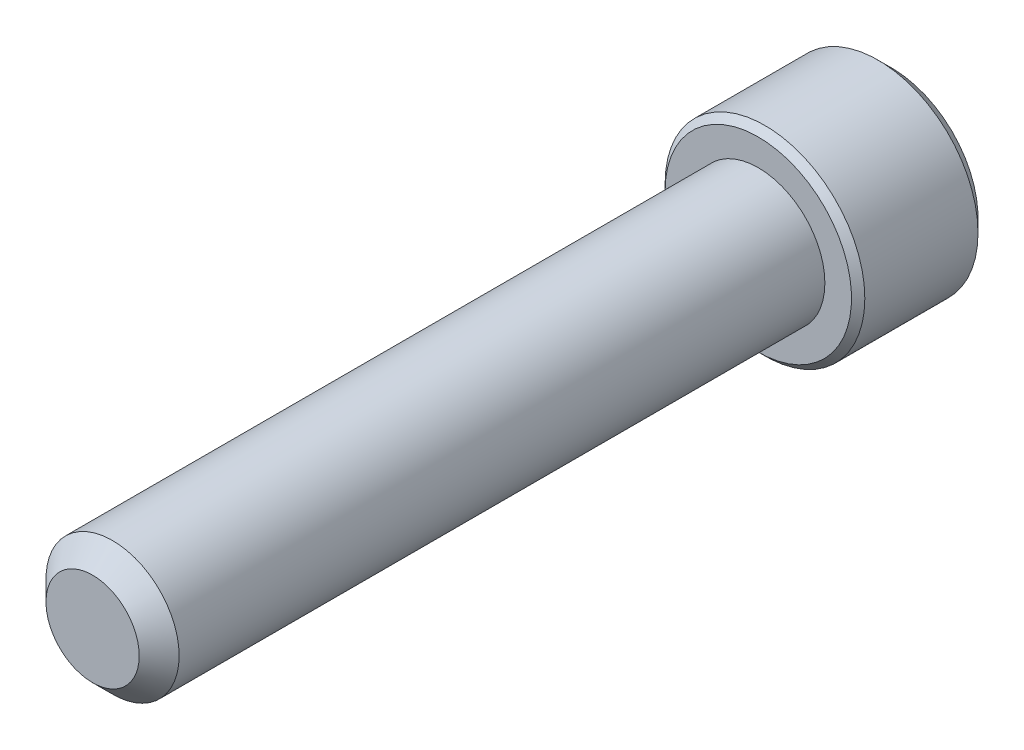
ISO-10303-21;
HEADER;
FILE_DESCRIPTION(('STEP AP214'),'2;1');
FILE_NAME('part.step','',(''),(''),'','','');
FILE_SCHEMA(('AUTOMOTIVE_DESIGN { 1 0 10303 214 1 1 1 1 }'));
ENDSEC;
DATA;
#1=APPLICATION_CONTEXT('core data for automotive mechanical design processes');
#2=APPLICATION_PROTOCOL_DEFINITION('international standard','automotive_design',2000,#1);
#3=PRODUCT_CONTEXT('',#1,'mechanical');
#4=PRODUCT('Part','Part','',(#3));
#5=PRODUCT_RELATED_PRODUCT_CATEGORY('part','',(#4));
#6=PRODUCT_DEFINITION_FORMATION('','',#4);
#7=PRODUCT_DEFINITION_CONTEXT('part definition',#1,'design');
#8=PRODUCT_DEFINITION('design','',#6,#7);
#9=PRODUCT_DEFINITION_SHAPE('','',#8);
#10=(LENGTH_UNIT() NAMED_UNIT(*) SI_UNIT(.MILLI.,.METRE.));
#11=(NAMED_UNIT(*) PLANE_ANGLE_UNIT() SI_UNIT($,.RADIAN.));
#12=(NAMED_UNIT(*) SI_UNIT($,.STERADIAN.) SOLID_ANGLE_UNIT());
#13=UNCERTAINTY_MEASURE_WITH_UNIT(LENGTH_MEASURE(1.E-05),#10,'distance_accuracy_value','');
#14=(GEOMETRIC_REPRESENTATION_CONTEXT(3) GLOBAL_UNCERTAINTY_ASSIGNED_CONTEXT((#13)) GLOBAL_UNIT_ASSIGNED_CONTEXT((#10,
#11,#12)) REPRESENTATION_CONTEXT('',''));
#15=CARTESIAN_POINT('',(0.,0.,0.));
#16=DIRECTION('',(0.,0.,1.));
#17=DIRECTION('',(1.,0.,0.));
#18=AXIS2_PLACEMENT_3D('',#15,#16,#17);
#19=CARTESIAN_POINT('',(0.,0.,-31.75));
#20=DIRECTION('',(0.,0.,1.));
#21=DIRECTION('',(1.,0.,0.));
#22=AXIS2_PLACEMENT_3D('',#19,#20,#21);
#23=CYLINDRICAL_SURFACE('',#22,3.175);
#24=CARTESIAN_POINT('',(0.,0.,-0.952499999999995));
#25=DIRECTION('',(0.,0.,1.));
#26=DIRECTION('',(1.,0.,0.));
#27=AXIS2_PLACEMENT_3D('',#24,#25,#26);
#28=CIRCLE('',#27,3.175);
#29=CARTESIAN_POINT('',(3.175,0.,-0.952499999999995));
#30=VERTEX_POINT('',#29);
#31=EDGE_CURVE('E109',#30,#30,#28,.F.);
#32=ORIENTED_EDGE('',*,*,#31,.T.);
#33=EDGE_LOOP('',(#32));
#34=FACE_BOUND('',#33,.T.);
#35=CARTESIAN_POINT('',(0.,0.,-31.75));
#36=DIRECTION('',(0.,0.,-1.));
#37=DIRECTION('',(-1.,0.,0.));
#38=AXIS2_PLACEMENT_3D('',#35,#36,#37);
#39=CIRCLE('',#38,3.175);
#40=CARTESIAN_POINT('',(-3.175,0.,-31.75));
#41=VERTEX_POINT('',#40);
#42=EDGE_CURVE('E209',#41,#41,#39,.F.);
#43=ORIENTED_EDGE('',*,*,#42,.T.);
#44=EDGE_LOOP('',(#43));
#45=FACE_BOUND('',#44,.T.);
#46=ADVANCED_FACE('F35',(#34,#45),#23,.T.);
#47=CARTESIAN_POINT('',(0.,0.,0.));
#48=DIRECTION('',(0.,0.,1.));
#49=DIRECTION('',(1.,0.,0.));
#50=AXIS2_PLACEMENT_3D('',#47,#48,#49);
#51=PLANE('',#50);
#52=CARTESIAN_POINT('',(0.,0.,0.));
#53=DIRECTION('',(0.,0.,1.));
#54=DIRECTION('',(1.,0.,0.));
#55=AXIS2_PLACEMENT_3D('',#52,#53,#54);
#56=CIRCLE('',#55,2.22250000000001);
#57=CARTESIAN_POINT('',(2.22250000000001,0.,0.));
#58=VERTEX_POINT('',#57);
#59=EDGE_CURVE('E208',#58,#58,#56,.T.);
#60=ORIENTED_EDGE('',*,*,#59,.T.);
#61=EDGE_LOOP('',(#60));
#62=FACE_BOUND('',#61,.T.);
#63=ADVANCED_FACE('F186',(#62),#51,.T.);
#64=CARTESIAN_POINT('',(0.,0.,0.));
#65=DIRECTION('',(0.,0.,-1.));
#66=DIRECTION('',(-1.,0.,0.));
#67=AXIS2_PLACEMENT_3D('',#64,#65,#66);
#68=CONICAL_SURFACE('',#67,2.22250000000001,0.785398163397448);
#69=ORIENTED_EDGE('',*,*,#31,.F.);
#70=EDGE_LOOP('',(#69));
#71=FACE_BOUND('',#70,.T.);
#72=ORIENTED_EDGE('',*,*,#59,.F.);
#73=EDGE_LOOP('',(#72));
#74=FACE_BOUND('',#73,.T.);
#75=ADVANCED_FACE('F192',(#71,#74),#68,.T.);
#76=CARTESIAN_POINT('',(0.,0.,-38.1));
#77=DIRECTION('',(0.,0.,1.));
#78=DIRECTION('',(1.,0.,0.));
#79=AXIS2_PLACEMENT_3D('',#76,#77,#78);
#80=CYLINDRICAL_SURFACE('',#79,4.7625);
#81=CARTESIAN_POINT('',(0.,0.,-32.0675));
#82=DIRECTION('',(0.,0.,-1.));
#83=DIRECTION('',(-1.,0.,0.));
#84=AXIS2_PLACEMENT_3D('',#81,#82,#83);
#85=CIRCLE('',#84,4.7625);
#86=CARTESIAN_POINT('',(-4.7625,0.,-32.0675));
#87=VERTEX_POINT('',#86);
#88=EDGE_CURVE('E43',#87,#87,#85,.T.);
#89=ORIENTED_EDGE('',*,*,#88,.T.);
#90=EDGE_LOOP('',(#89));
#91=FACE_BOUND('',#90,.T.);
#92=CARTESIAN_POINT('',(0.,0.,-37.465));
#93=DIRECTION('',(0.,0.,-1.));
#94=DIRECTION('',(-1.,0.,0.));
#95=AXIS2_PLACEMENT_3D('',#92,#93,#94);
#96=CIRCLE('',#95,4.7625);
#97=CARTESIAN_POINT('',(-4.7625,0.,-37.465));
#98=VERTEX_POINT('',#97);
#99=EDGE_CURVE('E169',#98,#98,#96,.F.);
#100=ORIENTED_EDGE('',*,*,#99,.T.);
#101=EDGE_LOOP('',(#100));
#102=FACE_BOUND('',#101,.T.);
#103=ADVANCED_FACE('F174',(#91,#102),#80,.T.);
#104=CARTESIAN_POINT('',(0.,0.,-38.1));
#105=DIRECTION('',(0.,0.,-1.));
#106=DIRECTION('',(-1.,0.,0.));
#107=AXIS2_PLACEMENT_3D('',#104,#105,#106);
#108=PLANE('',#107);
#109=CARTESIAN_POINT('',(0.,0.,-38.1));
#110=DIRECTION('',(0.,0.,-1.));
#111=DIRECTION('',(-1.,0.,0.));
#112=AXIS2_PLACEMENT_3D('',#109,#110,#111);
#113=CIRCLE('',#112,4.1275);
#114=CARTESIAN_POINT('',(-4.1275,0.,-38.1));
#115=VERTEX_POINT('',#114);
#116=EDGE_CURVE('E108',#115,#115,#113,.T.);
#117=ORIENTED_EDGE('',*,*,#116,.T.);
#118=EDGE_LOOP('',(#117));
#119=FACE_BOUND('',#118,.T.);
#120=CARTESIAN_POINT('',(0.,0.,-38.1));
#121=DIRECTION('',(0.,0.,-1.));
#122=DIRECTION('',(-1.,0.,0.));
#123=AXIS2_PLACEMENT_3D('',#120,#121,#122);
#124=CIRCLE('',#123,2.74963065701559);
#125=CARTESIAN_POINT('',(-2.38125,1.3748153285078,-38.1));
#126=VERTEX_POINT('',#125);
#127=CARTESIAN_POINT('',(0.,2.74963065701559,-38.1));
#128=VERTEX_POINT('',#127);
#129=EDGE_CURVE('E89',#126,#128,#124,.T.);
#130=ORIENTED_EDGE('',*,*,#129,.F.);
#131=CARTESIAN_POINT('',(-2.38125,-1.3748153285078,-38.1));
#132=VERTEX_POINT('',#131);
#133=EDGE_CURVE('E49',#132,#126,#124,.T.);
#134=ORIENTED_EDGE('',*,*,#133,.F.);
#135=CARTESIAN_POINT('',(0.,-2.74963065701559,-38.1));
#136=VERTEX_POINT('',#135);
#137=EDGE_CURVE('E265',#136,#132,#124,.T.);
#138=ORIENTED_EDGE('',*,*,#137,.F.);
#139=CARTESIAN_POINT('',(2.38125,-1.3748153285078,-38.1));
#140=VERTEX_POINT('',#139);
#141=EDGE_CURVE('E56',#140,#136,#124,.T.);
#142=ORIENTED_EDGE('',*,*,#141,.F.);
#143=CARTESIAN_POINT('',(2.38125,1.3748153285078,-38.1));
#144=VERTEX_POINT('',#143);
#145=EDGE_CURVE('E130',#144,#140,#124,.T.);
#146=ORIENTED_EDGE('',*,*,#145,.F.);
#147=EDGE_CURVE('E98',#128,#144,#124,.T.);
#148=ORIENTED_EDGE('',*,*,#147,.F.);
#149=EDGE_LOOP('',(#130,#134,#138,#142,#146,#148));
#150=FACE_BOUND('',#149,.T.);
#151=ADVANCED_FACE('F129',(#119,#150),#108,.T.);
#152=CARTESIAN_POINT('',(0.,0.,-31.75));
#153=DIRECTION('',(0.,0.,-1.));
#154=DIRECTION('',(-1.,0.,0.));
#155=AXIS2_PLACEMENT_3D('',#152,#153,#154);
#156=PLANE('',#155);
#157=CARTESIAN_POINT('',(0.,0.,-31.75));
#158=DIRECTION('',(0.,0.,-1.));
#159=DIRECTION('',(-1.,0.,0.));
#160=AXIS2_PLACEMENT_3D('',#157,#158,#159);
#161=CIRCLE('',#160,4.44500000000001);
#162=CARTESIAN_POINT('',(-4.445,0.,-31.75));
#163=VERTEX_POINT('',#162);
#164=EDGE_CURVE('E11',#163,#163,#161,.F.);
#165=ORIENTED_EDGE('',*,*,#164,.T.);
#166=EDGE_LOOP('',(#165));
#167=FACE_BOUND('',#166,.T.);
#168=ORIENTED_EDGE('',*,*,#42,.F.);
#169=EDGE_LOOP('',(#168));
#170=FACE_BOUND('',#169,.T.);
#171=ADVANCED_FACE('F277',(#167,#170),#156,.F.);
#172=CARTESIAN_POINT('',(0.,0.,-38.1));
#173=DIRECTION('',(0.,0.,-1.));
#174=DIRECTION('',(-1.,0.,0.));
#175=AXIS2_PLACEMENT_3D('',#172,#173,#174);
#176=CONICAL_SURFACE('',#175,2.74963065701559,0.78539816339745);
#177=ORIENTED_EDGE('',*,*,#147,.T.);
#178=CARTESIAN_POINT('',(-0.000199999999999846,2.74974612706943,-38.1001154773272));
#179=CARTESIAN_POINT('',(0.0816567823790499,2.70248609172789,-38.0528948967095));
#180=CARTESIAN_POINT('',(0.16488233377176,2.65443579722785,-38.0084475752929));
#181=CARTESIAN_POINT('',(0.33458848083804,2.556455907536,-37.9270654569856));
#182=CARTESIAN_POINT('',(0.421085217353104,2.50651699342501,-37.8901759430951));
#183=CARTESIAN_POINT('',(0.595501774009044,2.40581754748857,-37.8269834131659));
#184=CARTESIAN_POINT('',(0.683377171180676,2.35508266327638,-37.8005215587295));
#185=CARTESIAN_POINT('',(0.861062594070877,2.25249593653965,-37.7597515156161));
#186=CARTESIAN_POINT('',(0.950867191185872,2.20064722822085,-37.7454128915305));
#187=CARTESIAN_POINT('',(1.10563960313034,2.11128933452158,-37.7324757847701));
#188=CARTESIAN_POINT('',(1.17040744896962,2.07389560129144,-37.7305606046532));
#189=CARTESIAN_POINT('',(1.29983727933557,1.99916925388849,-37.7337866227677));
#190=CARTESIAN_POINT('',(1.36449921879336,1.96183666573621,-37.7389302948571));
#191=CARTESIAN_POINT('',(1.4932125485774,1.88752399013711,-37.7559813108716));
#192=CARTESIAN_POINT('',(1.55726317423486,1.85054434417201,-37.7678962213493));
#193=CARTESIAN_POINT('',(1.68425683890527,1.77722451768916,-37.797835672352));
#194=CARTESIAN_POINT('',(1.74719996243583,1.74088428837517,-37.8158597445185));
#195=CARTESIAN_POINT('',(1.90842615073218,1.64780030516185,-37.8693688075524));
#196=CARTESIAN_POINT('',(2.00570949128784,1.59163374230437,-37.9088874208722));
#197=CARTESIAN_POINT('',(2.14875606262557,1.50904576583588,-37.9756003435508));
#198=CARTESIAN_POINT('',(2.19589628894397,1.48182934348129,-37.9990402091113));
#199=CARTESIAN_POINT('',(2.28930352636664,1.42790064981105,-38.0480566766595));
#200=CARTESIAN_POINT('',(2.33557105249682,1.40118808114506,-38.0736319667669));
#201=CARTESIAN_POINT('',(2.38145,1.37469985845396,-38.1001154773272));
#202=B_SPLINE_CURVE_WITH_KNOTS('',3,(#178,#179,#180,#181,#182,#183,#184,#185,#186,#187,#188,
#189,#190,#191,#192,#193,#194,#195,#196,#197,#198,#199,#200,#201),.UNSPECIFIED.,.F.,.F.,(4,2,2,
2,2,2,2,2,2,2,2,4),(0.,0.317196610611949,0.636241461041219,0.950218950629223,1.26340583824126,
1.48752413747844,1.71172100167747,1.93616888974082,2.16059957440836,2.51709639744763,
2.69486147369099,2.87251813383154),.UNSPECIFIED.);
#203=EDGE_CURVE('E103',#128,#144,#202,.T.);
#204=ORIENTED_EDGE('',*,*,#203,.F.);
#205=EDGE_LOOP('',(#177,#204));
#206=FACE_BOUND('',#205,.T.);
#207=ADVANCED_FACE('F104',(#206),#176,.F.);
#208=ORIENTED_EDGE('',*,*,#145,.T.);
#209=CARTESIAN_POINT('',(2.38125,-2.76261914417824,-38.9976170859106));
#210=CARTESIAN_POINT('',(2.38125,-2.69544479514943,-38.9467472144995));
#211=CARTESIAN_POINT('',(2.38125,-2.62789666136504,-38.896362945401));
#212=CARTESIAN_POINT('',(2.38125,-2.49190448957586,-38.7967837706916));
#213=CARTESIAN_POINT('',(2.38125,-2.42346023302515,-38.7475891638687));
#214=CARTESIAN_POINT('',(2.38125,-2.28502676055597,-38.6502575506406));
#215=CARTESIAN_POINT('',(2.38125,-2.21502968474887,-38.6021316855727));
#216=CARTESIAN_POINT('',(2.38125,-2.07385103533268,-38.5076556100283));
#217=CARTESIAN_POINT('',(2.38125,-2.00266954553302,-38.461305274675));
#218=CARTESIAN_POINT('',(2.38125,-1.85474026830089,-38.3681368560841));
#219=CARTESIAN_POINT('',(2.38125,-1.7779099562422,-38.3214491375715));
#220=CARTESIAN_POINT('',(2.38125,-1.62247617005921,-38.2311296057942));
#221=CARTESIAN_POINT('',(2.38125,-1.5438729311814,-38.1874973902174));
#222=CARTESIAN_POINT('',(2.38125,-1.38486272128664,-38.1042071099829));
#223=CARTESIAN_POINT('',(2.38125,-1.30446163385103,-38.0645379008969));
#224=CARTESIAN_POINT('',(2.38125,-1.14145314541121,-37.9900690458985));
#225=CARTESIAN_POINT('',(2.38125,-1.05884677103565,-37.9552671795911));
#226=CARTESIAN_POINT('',(2.38125,-0.898296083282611,-37.8944298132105));
#227=CARTESIAN_POINT('',(2.38125,-0.820539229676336,-37.8679047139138));
#228=CARTESIAN_POINT('',(2.38125,-0.663135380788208,-37.82108983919));
#229=CARTESIAN_POINT('',(2.38125,-0.583488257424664,-37.8008004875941));
#230=CARTESIAN_POINT('',(2.38125,-0.424114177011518,-37.7678604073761));
#231=CARTESIAN_POINT('',(2.38125,-0.344414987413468,-37.7550775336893));
#232=CARTESIAN_POINT('',(2.38125,-0.184141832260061,-37.7374018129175));
#233=CARTESIAN_POINT('',(2.38125,-0.103568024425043,-37.7325075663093));
#234=CARTESIAN_POINT('',(2.38125,0.0546452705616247,-37.7309814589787));
#235=CARTESIAN_POINT('',(2.38125,0.132281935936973,-37.7340477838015));
#236=CARTESIAN_POINT('',(2.38125,0.28689976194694,-37.7476029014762));
#237=CARTESIAN_POINT('',(2.38125,0.363880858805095,-37.7580924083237));
#238=CARTESIAN_POINT('',(2.38125,0.517934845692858,-37.7860957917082));
#239=CARTESIAN_POINT('',(2.38125,0.594985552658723,-37.8037299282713));
#240=CARTESIAN_POINT('',(2.38125,0.747397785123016,-37.8450790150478));
#241=CARTESIAN_POINT('',(2.38125,0.822759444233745,-37.8687934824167));
#242=CARTESIAN_POINT('',(2.38125,1.05910849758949,-37.9521079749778));
#243=CARTESIAN_POINT('',(2.38125,1.21677702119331,-38.0211581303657));
#244=CARTESIAN_POINT('',(2.38125,1.44750538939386,-38.1362600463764));
#245=CARTESIAN_POINT('',(2.38125,1.52359597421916,-38.1766390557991));
#246=CARTESIAN_POINT('',(2.38125,1.67404919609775,-38.2605045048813));
#247=CARTESIAN_POINT('',(2.38125,1.74841214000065,-38.3039903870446));
#248=CARTESIAN_POINT('',(2.38125,1.89195740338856,-38.3912197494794));
#249=CARTESIAN_POINT('',(2.38125,1.96121356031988,-38.4348431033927));
#250=CARTESIAN_POINT('',(2.38125,2.09853826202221,-38.5239297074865));
#251=CARTESIAN_POINT('',(2.38125,2.16660671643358,-38.5693930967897));
#252=CARTESIAN_POINT('',(2.38125,2.30115854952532,-38.6614552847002));
#253=CARTESIAN_POINT('',(2.38125,2.36765030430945,-38.7080418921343));
#254=CARTESIAN_POINT('',(2.38125,2.49972444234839,-38.8024503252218));
#255=CARTESIAN_POINT('',(2.38125,2.56530707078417,-38.8502718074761));
#256=CARTESIAN_POINT('',(2.38125,2.63050907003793,-38.8985984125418));
#257=B_SPLINE_CURVE_WITH_KNOTS('',3,(#209,#210,#211,#212,#213,#214,#215,#216,#217,#218,#219,
#220,#221,#222,#223,#224,#225,#226,#227,#228,#229,#230,#231,#232,#233,#234,#235,#236,#237,#238,
#239,#240,#241,#242,#243,#244,#245,#246,#247,#248,#249,#250,#251,#252,#253,#254,#255,#256),
.UNSPECIFIED.,.F.,.F.,(4,2,2,2,2,2,2,2,2,2,2,2,2,2,2,2,2,2,2,2,2,2,2,4),(0.,0.25279187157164,
0.50564658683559,0.760459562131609,1.01525458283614,1.28490904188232,1.55452792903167,
1.82336591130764,2.09208085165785,2.33833488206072,2.58460564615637,2.82639989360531,
3.06815123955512,3.30087188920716,3.53361492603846,3.77045005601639,4.00726638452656,
4.52203846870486,4.78044014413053,5.03879556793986,5.28431582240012,5.52985467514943,
5.77340315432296,6.0168846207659),.UNSPECIFIED.);
#258=EDGE_CURVE('E97',#144,#140,#257,.F.);
#259=ORIENTED_EDGE('',*,*,#258,.F.);
#260=EDGE_LOOP('',(#208,#259));
#261=FACE_BOUND('',#260,.T.);
#262=ADVANCED_FACE('F271',(#261),#176,.F.);
#263=ORIENTED_EDGE('',*,*,#141,.T.);
#264=CARTESIAN_POINT('',(2.38145,-1.37469985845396,-38.1001154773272));
#265=CARTESIAN_POINT('',(2.29959321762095,-1.4219598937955,-38.0528948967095));
#266=CARTESIAN_POINT('',(2.21636766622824,-1.47001018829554,-38.0084475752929));
#267=CARTESIAN_POINT('',(2.04666151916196,-1.56799007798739,-37.9270654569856));
#268=CARTESIAN_POINT('',(1.9601647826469,-1.61792899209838,-37.8901759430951));
#269=CARTESIAN_POINT('',(1.78574822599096,-1.71862843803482,-37.8269834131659));
#270=CARTESIAN_POINT('',(1.69787282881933,-1.769363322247,-37.8005215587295));
#271=CARTESIAN_POINT('',(1.52018740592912,-1.87195004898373,-37.7597515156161));
#272=CARTESIAN_POINT('',(1.43038280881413,-1.92379875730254,-37.7454128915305));
#273=CARTESIAN_POINT('',(1.27561039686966,-2.01315665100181,-37.7324757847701));
#274=CARTESIAN_POINT('',(1.21084255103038,-2.05055038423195,-37.7305606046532));
#275=CARTESIAN_POINT('',(1.08141272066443,-2.1252767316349,-37.7337866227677));
#276=CARTESIAN_POINT('',(1.01675078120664,-2.16260931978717,-37.7389302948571));
#277=CARTESIAN_POINT('',(0.888037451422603,-2.23692199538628,-37.7559813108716));
#278=CARTESIAN_POINT('',(0.823986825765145,-2.27390164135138,-37.7678962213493));
#279=CARTESIAN_POINT('',(0.696993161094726,-2.34722146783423,-37.797835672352));
#280=CARTESIAN_POINT('',(0.634050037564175,-2.38356169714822,-37.8158597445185));
#281=CARTESIAN_POINT('',(0.472823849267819,-2.47664568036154,-37.8693688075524));
#282=CARTESIAN_POINT('',(0.37554050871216,-2.53281224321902,-37.9088874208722));
#283=CARTESIAN_POINT('',(0.232493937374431,-2.61540021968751,-37.9756003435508));
#284=CARTESIAN_POINT('',(0.185353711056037,-2.64261664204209,-37.9990402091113));
#285=CARTESIAN_POINT('',(0.0919464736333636,-2.69654533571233,-38.0480566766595));
#286=CARTESIAN_POINT('',(0.0456789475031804,-2.72325790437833,-38.0736319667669));
#287=CARTESIAN_POINT('',(-0.000199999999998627,-2.74974612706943,-38.1001154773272));
#288=B_SPLINE_CURVE_WITH_KNOTS('',3,(#264,#265,#266,#267,#268,#269,#270,#271,#272,#273,#274,
#275,#276,#277,#278,#279,#280,#281,#282,#283,#284,#285,#286,#287),.UNSPECIFIED.,.F.,.F.,(4,2,2,
2,2,2,2,2,2,2,2,4),(0.,0.317196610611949,0.636241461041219,0.950218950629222,1.26340583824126,
1.48752413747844,1.71172100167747,1.93616888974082,2.16059957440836,2.51709639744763,
2.69486147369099,2.87251813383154),.UNSPECIFIED.);
#289=EDGE_CURVE('E139',#140,#136,#288,.T.);
#290=ORIENTED_EDGE('',*,*,#289,.F.);
#291=EDGE_LOOP('',(#263,#290));
#292=FACE_BOUND('',#291,.T.);
#293=ADVANCED_FACE('F268',(#292),#176,.F.);
#294=ORIENTED_EDGE('',*,*,#137,.T.);
#295=CARTESIAN_POINT('',(0.000199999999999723,-2.74974612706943,-38.1001154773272));
#296=CARTESIAN_POINT('',(-0.0816567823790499,-2.70248609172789,-38.0528948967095));
#297=CARTESIAN_POINT('',(-0.16488233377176,-2.65443579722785,-38.0084475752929));
#298=CARTESIAN_POINT('',(-0.33458848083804,-2.556455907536,-37.9270654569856));
#299=CARTESIAN_POINT('',(-0.421085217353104,-2.50651699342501,-37.8901759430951));
#300=CARTESIAN_POINT('',(-0.595501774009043,-2.40581754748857,-37.8269834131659));
#301=CARTESIAN_POINT('',(-0.683377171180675,-2.35508266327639,-37.8005215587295));
#302=CARTESIAN_POINT('',(-0.861062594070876,-2.25249593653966,-37.7597515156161));
#303=CARTESIAN_POINT('',(-0.950867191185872,-2.20064722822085,-37.7454128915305));
#304=CARTESIAN_POINT('',(-1.10563960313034,-2.11128933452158,-37.7324757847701));
#305=CARTESIAN_POINT('',(-1.17040744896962,-2.07389560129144,-37.7305606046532));
#306=CARTESIAN_POINT('',(-1.29983727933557,-1.99916925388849,-37.7337866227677));
#307=CARTESIAN_POINT('',(-1.36449921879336,-1.96183666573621,-37.7389302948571));
#308=CARTESIAN_POINT('',(-1.4932125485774,-1.88752399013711,-37.7559813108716));
#309=CARTESIAN_POINT('',(-1.55726317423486,-1.85054434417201,-37.7678962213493));
#310=CARTESIAN_POINT('',(-1.68425683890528,-1.77722451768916,-37.797835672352));
#311=CARTESIAN_POINT('',(-1.74719996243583,-1.74088428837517,-37.8158597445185));
#312=CARTESIAN_POINT('',(-1.90842615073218,-1.64780030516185,-37.8693688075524));
#313=CARTESIAN_POINT('',(-2.00570949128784,-1.59163374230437,-37.9088874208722));
#314=CARTESIAN_POINT('',(-2.14875606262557,-1.50904576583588,-37.9756003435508));
#315=CARTESIAN_POINT('',(-2.19589628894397,-1.48182934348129,-37.9990402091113));
#316=CARTESIAN_POINT('',(-2.28930352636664,-1.42790064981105,-38.0480566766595));
#317=CARTESIAN_POINT('',(-2.33557105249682,-1.40118808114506,-38.0736319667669));
#318=CARTESIAN_POINT('',(-2.38145,-1.37469985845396,-38.1001154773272));
#319=B_SPLINE_CURVE_WITH_KNOTS('',3,(#295,#296,#297,#298,#299,#300,#301,#302,#303,#304,#305,
#306,#307,#308,#309,#310,#311,#312,#313,#314,#315,#316,#317,#318),.UNSPECIFIED.,.F.,.F.,(4,2,2,
2,2,2,2,2,2,2,2,4),(0.,0.317196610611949,0.636241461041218,0.950218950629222,1.26340583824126,
1.48752413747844,1.71172100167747,1.93616888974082,2.16059957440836,2.51709639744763,
2.69486147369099,2.87251813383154),.UNSPECIFIED.);
#320=EDGE_CURVE('E243',#136,#132,#319,.T.);
#321=ORIENTED_EDGE('',*,*,#320,.F.);
#322=EDGE_LOOP('',(#294,#321));
#323=FACE_BOUND('',#322,.T.);
#324=ADVANCED_FACE('F267',(#323),#176,.F.);
#325=ORIENTED_EDGE('',*,*,#133,.T.);
#326=CARTESIAN_POINT('',(-2.38125,-2.76261914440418,-38.9976170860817));
#327=CARTESIAN_POINT('',(-2.38125,-2.69544479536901,-38.9467472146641));
#328=CARTESIAN_POINT('',(-2.38125,-2.62789666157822,-38.8963629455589));
#329=CARTESIAN_POINT('',(-2.38125,-2.4919044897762,-38.7967837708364));
#330=CARTESIAN_POINT('',(-2.38125,-2.42346023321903,-38.7475891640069));
#331=CARTESIAN_POINT('',(-2.38125,-2.28502676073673,-38.6502575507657));
#332=CARTESIAN_POINT('',(-2.38125,-2.21502968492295,-38.6021316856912));
#333=CARTESIAN_POINT('',(-2.38125,-2.0738510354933,-38.5076556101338));
#334=CARTESIAN_POINT('',(-2.38125,-2.00266954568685,-38.4613052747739));
#335=CARTESIAN_POINT('',(-2.38125,-1.85474026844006,-38.3681368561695));
#336=CARTESIAN_POINT('',(-2.38125,-1.7779099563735,-38.3214491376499));
#337=CARTESIAN_POINT('',(-2.38125,-1.62247617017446,-38.231129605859));
#338=CARTESIAN_POINT('',(-2.38125,-1.54387293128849,-38.1874973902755));
#339=CARTESIAN_POINT('',(-2.38125,-1.38486272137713,-38.1042071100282));
#340=CARTESIAN_POINT('',(-2.38125,-1.30446163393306,-38.0645379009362));
#341=CARTESIAN_POINT('',(-2.38125,-1.14145314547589,-37.9900690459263));
#342=CARTESIAN_POINT('',(-2.38125,-1.05884677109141,-37.9552671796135));
#343=CARTESIAN_POINT('',(-2.38125,-0.89829608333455,-37.894429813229));
#344=CARTESIAN_POINT('',(-2.38125,-0.820539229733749,-37.8679047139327));
#345=CARTESIAN_POINT('',(-2.38125,-0.663135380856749,-37.8210898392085));
#346=CARTESIAN_POINT('',(-2.38125,-0.583488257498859,-37.8008004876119));
#347=CARTESIAN_POINT('',(-2.38125,-0.424114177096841,-37.7678604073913));
#348=CARTESIAN_POINT('',(-2.38125,-0.34441498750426,-37.7550775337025));
#349=CARTESIAN_POINT('',(-2.38125,-0.184141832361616,-37.7374018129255));
#350=CARTESIAN_POINT('',(-2.38125,-0.10356802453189,-37.7325075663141));
#351=CARTESIAN_POINT('',(-2.38125,0.0546452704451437,-37.7309814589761));
#352=CARTESIAN_POINT('',(-2.38125,0.132281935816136,-37.7340477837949));
#353=CARTESIAN_POINT('',(-2.38125,0.286899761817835,-37.7476029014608));
#354=CARTESIAN_POINT('',(-2.38125,0.363880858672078,-37.7580924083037));
#355=CARTESIAN_POINT('',(-2.38125,0.517934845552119,-37.7860957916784));
#356=CARTESIAN_POINT('',(-2.38125,0.594985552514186,-37.8037299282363));
#357=CARTESIAN_POINT('',(-2.38125,0.747397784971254,-37.8450790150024));
#358=CARTESIAN_POINT('',(-2.38125,0.822759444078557,-37.8687934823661));
#359=CARTESIAN_POINT('',(-2.38125,1.05910849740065,-37.9521079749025));
#360=CARTESIAN_POINT('',(-2.38125,1.21677702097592,-38.0211581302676));
#361=CARTESIAN_POINT('',(-2.38125,1.44750538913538,-38.1362600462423));
#362=CARTESIAN_POINT('',(-2.38125,1.52359597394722,-38.1766390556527));
#363=CARTESIAN_POINT('',(-2.38125,1.67404919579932,-38.2605045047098));
#364=CARTESIAN_POINT('',(-2.38125,1.7484121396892,-38.3039903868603));
#365=CARTESIAN_POINT('',(-2.38125,1.89195740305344,-38.391219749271));
#366=CARTESIAN_POINT('',(-2.38125,1.96121355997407,-38.4348431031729));
#367=CARTESIAN_POINT('',(-2.38125,2.09853826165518,-38.5239297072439));
#368=CARTESIAN_POINT('',(-2.38125,2.16660671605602,-38.5693930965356));
#369=CARTESIAN_POINT('',(-2.38125,2.30115854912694,-38.6614552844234));
#370=CARTESIAN_POINT('',(-2.38125,2.36765030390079,-38.7080418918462));
#371=CARTESIAN_POINT('',(-2.38125,2.49972444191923,-38.8024503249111));
#372=CARTESIAN_POINT('',(-2.38125,2.5653070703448,-38.8502718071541));
#373=CARTESIAN_POINT('',(-2.38125,2.63050906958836,-38.8985984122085));
#374=B_SPLINE_CURVE_WITH_KNOTS('',3,(#326,#327,#328,#329,#330,#331,#332,#333,#334,#335,#336,
#337,#338,#339,#340,#341,#342,#343,#344,#345,#346,#347,#348,#349,#350,#351,#352,#353,#354,#355,
#356,#357,#358,#359,#360,#361,#362,#363,#364,#365,#366,#367,#368,#369,#370,#371,#372,#373),
.UNSPECIFIED.,.F.,.F.,(4,2,2,2,2,2,2,2,2,2,2,2,2,2,2,2,2,2,2,2,2,2,2,4),(0.,0.252791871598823,
0.505646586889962,0.760459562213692,1.01525458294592,1.2849090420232,1.55452792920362,
1.82336591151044,2.09208085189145,2.33833488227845,2.58460564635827,2.82639989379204,
3.06815123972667,3.30087188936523,3.53361492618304,3.77045005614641,4.00726638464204,
4.52203846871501,4.78044014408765,5.03879556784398,5.2843158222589,5.52985467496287,
5.77340315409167,6.01688462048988),.UNSPECIFIED.);
#375=EDGE_CURVE('E119',#132,#126,#374,.T.);
#376=ORIENTED_EDGE('',*,*,#375,.F.);
#377=EDGE_LOOP('',(#325,#376));
#378=FACE_BOUND('',#377,.T.);
#379=ADVANCED_FACE('F284',(#378),#176,.F.);
#380=ORIENTED_EDGE('',*,*,#129,.T.);
#381=CARTESIAN_POINT('',(-2.38145,1.37469985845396,-38.1001154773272));
#382=CARTESIAN_POINT('',(-2.29959321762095,1.4219598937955,-38.0528948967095));
#383=CARTESIAN_POINT('',(-2.21636766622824,1.47001018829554,-38.0084475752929));
#384=CARTESIAN_POINT('',(-2.04666151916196,1.56799007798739,-37.9270654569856));
#385=CARTESIAN_POINT('',(-1.9601647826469,1.61792899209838,-37.8901759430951));
#386=CARTESIAN_POINT('',(-1.78574822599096,1.71862843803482,-37.8269834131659));
#387=CARTESIAN_POINT('',(-1.69787282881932,1.76936332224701,-37.8005215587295));
#388=CARTESIAN_POINT('',(-1.52018740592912,1.87195004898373,-37.7597515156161));
#389=CARTESIAN_POINT('',(-1.43038280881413,1.92379875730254,-37.7454128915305));
#390=CARTESIAN_POINT('',(-1.27561039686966,2.01315665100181,-37.7324757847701));
#391=CARTESIAN_POINT('',(-1.21084255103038,2.05055038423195,-37.7305606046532));
#392=CARTESIAN_POINT('',(-1.08141272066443,2.1252767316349,-37.7337866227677));
#393=CARTESIAN_POINT('',(-1.01675078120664,2.16260931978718,-37.7389302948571));
#394=CARTESIAN_POINT('',(-0.888037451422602,2.23692199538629,-37.7559813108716));
#395=CARTESIAN_POINT('',(-0.823986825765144,2.27390164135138,-37.7678962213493));
#396=CARTESIAN_POINT('',(-0.696993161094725,2.34722146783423,-37.797835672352));
#397=CARTESIAN_POINT('',(-0.634050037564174,2.38356169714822,-37.8158597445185));
#398=CARTESIAN_POINT('',(-0.472823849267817,2.47664568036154,-37.8693688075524));
#399=CARTESIAN_POINT('',(-0.375540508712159,2.53281224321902,-37.9088874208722));
#400=CARTESIAN_POINT('',(-0.23249393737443,2.61540021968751,-37.9756003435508));
#401=CARTESIAN_POINT('',(-0.185353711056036,2.64261664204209,-37.9990402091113));
#402=CARTESIAN_POINT('',(-0.0919464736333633,2.69654533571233,-38.0480566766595));
#403=CARTESIAN_POINT('',(-0.0456789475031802,2.72325790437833,-38.0736319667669));
#404=CARTESIAN_POINT('',(0.000199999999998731,2.74974612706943,-38.1001154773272));
#405=B_SPLINE_CURVE_WITH_KNOTS('',3,(#381,#382,#383,#384,#385,#386,#387,#388,#389,#390,#391,
#392,#393,#394,#395,#396,#397,#398,#399,#400,#401,#402,#403,#404),.UNSPECIFIED.,.F.,.F.,(4,2,2,
2,2,2,2,2,2,2,2,4),(0.,0.317196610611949,0.636241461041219,0.950218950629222,1.26340583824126,
1.48752413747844,1.71172100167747,1.93616888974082,2.16059957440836,2.51709639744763,
2.69486147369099,2.87251813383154),.UNSPECIFIED.);
#406=EDGE_CURVE('E93',#126,#128,#405,.T.);
#407=ORIENTED_EDGE('',*,*,#406,.F.);
#408=EDGE_LOOP('',(#380,#407));
#409=FACE_BOUND('',#408,.T.);
#410=ADVANCED_FACE('F91',(#409),#176,.F.);
#411=CARTESIAN_POINT('',(2.38125,4.12444598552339,-34.528125));
#412=DIRECTION('',(0.,0.,-1.));
#413=DIRECTION('',(-1.,0.,0.));
#414=AXIS2_PLACEMENT_3D('',#411,#412,#413);
#415=PLANE('',#414);
#416=DIRECTION('',(0.866025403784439,0.5,0.));
#417=VECTOR('',#416,1.);
#418=CARTESIAN_POINT('',(-2.38125,1.3748153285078,-34.528125));
#419=LINE('',#418,#417);
#420=CARTESIAN_POINT('',(-2.38125,1.3748153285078,-34.528125));
#421=VERTEX_POINT('',#420);
#422=CARTESIAN_POINT('',(0.,2.74963065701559,-34.528125));
#423=VERTEX_POINT('',#422);
#424=EDGE_CURVE('E118',#421,#423,#419,.T.);
#425=ORIENTED_EDGE('',*,*,#424,.T.);
#426=DIRECTION('',(0.866025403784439,-0.5,0.));
#427=VECTOR('',#426,1.);
#428=CARTESIAN_POINT('',(0.,2.74963065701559,-34.528125));
#429=LINE('',#428,#427);
#430=CARTESIAN_POINT('',(2.38125,1.3748153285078,-34.528125));
#431=VERTEX_POINT('',#430);
#432=EDGE_CURVE('E123',#423,#431,#429,.T.);
#433=ORIENTED_EDGE('',*,*,#432,.T.);
#434=DIRECTION('',(0.,-1.,0.));
#435=VECTOR('',#434,1.);
#436=CARTESIAN_POINT('',(2.38125,1.3748153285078,-34.528125));
#437=LINE('',#436,#435);
#438=CARTESIAN_POINT('',(2.38125,-1.3748153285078,-34.528125));
#439=VERTEX_POINT('',#438);
#440=EDGE_CURVE('E231',#431,#439,#437,.T.);
#441=ORIENTED_EDGE('',*,*,#440,.T.);
#442=DIRECTION('',(-0.866025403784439,-0.5,0.));
#443=VECTOR('',#442,1.);
#444=CARTESIAN_POINT('',(2.38125,-1.3748153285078,-34.528125));
#445=LINE('',#444,#443);
#446=CARTESIAN_POINT('',(0.,-2.74963065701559,-34.528125));
#447=VERTEX_POINT('',#446);
#448=EDGE_CURVE('E228',#439,#447,#445,.T.);
#449=ORIENTED_EDGE('',*,*,#448,.T.);
#450=DIRECTION('',(-0.866025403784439,0.5,0.));
#451=VECTOR('',#450,1.);
#452=CARTESIAN_POINT('',(0.,-2.74963065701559,-34.528125));
#453=LINE('',#452,#451);
#454=CARTESIAN_POINT('',(-2.38125,-1.3748153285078,-34.528125));
#455=VERTEX_POINT('',#454);
#456=EDGE_CURVE('E225',#447,#455,#453,.T.);
#457=ORIENTED_EDGE('',*,*,#456,.T.);
#458=DIRECTION('',(0.,1.,0.));
#459=VECTOR('',#458,1.);
#460=CARTESIAN_POINT('',(-2.38125,-1.3748153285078,-34.528125));
#461=LINE('',#460,#459);
#462=EDGE_CURVE('E126',#455,#421,#461,.T.);
#463=ORIENTED_EDGE('',*,*,#462,.T.);
#464=EDGE_LOOP('',(#425,#433,#441,#449,#457,#463));
#465=FACE_BOUND('',#464,.T.);
#466=ADVANCED_FACE('F158',(#465),#415,.T.);
#467=CARTESIAN_POINT('',(0.,2.74963065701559,-34.528125));
#468=DIRECTION('',(0.5,0.866025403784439,0.));
#469=DIRECTION('',(-0.866025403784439,0.5,0.));
#470=AXIS2_PLACEMENT_3D('',#467,#468,#469);
#471=PLANE('',#470);
#472=DIRECTION('',(0.,0.,-1.));
#473=VECTOR('',#472,1.);
#474=CARTESIAN_POINT('',(0.,2.74963065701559,-34.528125));
#475=LINE('',#474,#473);
#476=EDGE_CURVE('E115',#423,#128,#475,.T.);
#477=ORIENTED_EDGE('',*,*,#476,.T.);
#478=ORIENTED_EDGE('',*,*,#203,.T.);
#479=DIRECTION('',(0.,0.,-1.));
#480=VECTOR('',#479,1.);
#481=CARTESIAN_POINT('',(2.38125,1.3748153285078,-34.528125));
#482=LINE('',#481,#480);
#483=EDGE_CURVE('E125',#431,#144,#482,.T.);
#484=ORIENTED_EDGE('',*,*,#483,.F.);
#485=ORIENTED_EDGE('',*,*,#432,.F.);
#486=EDGE_LOOP('',(#477,#478,#484,#485));
#487=FACE_BOUND('',#486,.T.);
#488=ADVANCED_FACE('F121',(#487),#471,.F.);
#489=CARTESIAN_POINT('',(2.38125,1.3748153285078,-34.528125));
#490=DIRECTION('',(1.,0.,0.));
#491=DIRECTION('',(0.,0.,-1.));
#492=AXIS2_PLACEMENT_3D('',#489,#490,#491);
#493=PLANE('',#492);
#494=ORIENTED_EDGE('',*,*,#483,.T.);
#495=ORIENTED_EDGE('',*,*,#258,.T.);
#496=DIRECTION('',(0.,0.,-1.));
#497=VECTOR('',#496,1.);
#498=CARTESIAN_POINT('',(2.38125,-1.3748153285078,-34.528125));
#499=LINE('',#498,#497);
#500=EDGE_CURVE('E214',#439,#140,#499,.T.);
#501=ORIENTED_EDGE('',*,*,#500,.F.);
#502=ORIENTED_EDGE('',*,*,#440,.F.);
#503=EDGE_LOOP('',(#494,#495,#501,#502));
#504=FACE_BOUND('',#503,.T.);
#505=ADVANCED_FACE('F147',(#504),#493,.F.);
#506=CARTESIAN_POINT('',(2.38125,-1.3748153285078,-34.528125));
#507=DIRECTION('',(0.5,-0.866025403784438,0.));
#508=DIRECTION('',(0.866025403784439,0.5,0.));
#509=AXIS2_PLACEMENT_3D('',#506,#507,#508);
#510=PLANE('',#509);
#511=ORIENTED_EDGE('',*,*,#500,.T.);
#512=ORIENTED_EDGE('',*,*,#289,.T.);
#513=DIRECTION('',(0.,0.,-1.));
#514=VECTOR('',#513,1.);
#515=CARTESIAN_POINT('',(0.,-2.74963065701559,-34.528125));
#516=LINE('',#515,#514);
#517=EDGE_CURVE('E217',#447,#136,#516,.T.);
#518=ORIENTED_EDGE('',*,*,#517,.F.);
#519=ORIENTED_EDGE('',*,*,#448,.F.);
#520=EDGE_LOOP('',(#511,#512,#518,#519));
#521=FACE_BOUND('',#520,.T.);
#522=ADVANCED_FACE('F151',(#521),#510,.F.);
#523=CARTESIAN_POINT('',(0.,-2.74963065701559,-34.528125));
#524=DIRECTION('',(-0.5,-0.866025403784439,0.));
#525=DIRECTION('',(0.866025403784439,-0.5,0.));
#526=AXIS2_PLACEMENT_3D('',#523,#524,#525);
#527=PLANE('',#526);
#528=ORIENTED_EDGE('',*,*,#517,.T.);
#529=ORIENTED_EDGE('',*,*,#320,.T.);
#530=DIRECTION('',(0.,0.,-1.));
#531=VECTOR('',#530,1.);
#532=CARTESIAN_POINT('',(-2.38125,-1.3748153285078,-34.528125));
#533=LINE('',#532,#531);
#534=EDGE_CURVE('E220',#455,#132,#533,.T.);
#535=ORIENTED_EDGE('',*,*,#534,.F.);
#536=ORIENTED_EDGE('',*,*,#456,.F.);
#537=EDGE_LOOP('',(#528,#529,#535,#536));
#538=FACE_BOUND('',#537,.T.);
#539=ADVANCED_FACE('F250',(#538),#527,.F.);
#540=CARTESIAN_POINT('',(-2.38125,-1.3748153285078,-34.528125));
#541=DIRECTION('',(-1.,0.,0.));
#542=DIRECTION('',(0.,-1.,0.));
#543=AXIS2_PLACEMENT_3D('',#540,#541,#542);
#544=PLANE('',#543);
#545=ORIENTED_EDGE('',*,*,#534,.T.);
#546=ORIENTED_EDGE('',*,*,#375,.T.);
#547=DIRECTION('',(0.,0.,-1.));
#548=VECTOR('',#547,1.);
#549=CARTESIAN_POINT('',(-2.38125,1.3748153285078,-34.528125));
#550=LINE('',#549,#548);
#551=EDGE_CURVE('E117',#421,#126,#550,.T.);
#552=ORIENTED_EDGE('',*,*,#551,.F.);
#553=ORIENTED_EDGE('',*,*,#462,.F.);
#554=EDGE_LOOP('',(#545,#546,#552,#553));
#555=FACE_BOUND('',#554,.T.);
#556=ADVANCED_FACE('F247',(#555),#544,.F.);
#557=CARTESIAN_POINT('',(-2.38125,1.3748153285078,-34.528125));
#558=DIRECTION('',(-0.5,0.866025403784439,0.));
#559=DIRECTION('',(-0.866025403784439,-0.5,0.));
#560=AXIS2_PLACEMENT_3D('',#557,#558,#559);
#561=PLANE('',#560);
#562=ORIENTED_EDGE('',*,*,#551,.T.);
#563=ORIENTED_EDGE('',*,*,#406,.T.);
#564=ORIENTED_EDGE('',*,*,#476,.F.);
#565=ORIENTED_EDGE('',*,*,#424,.F.);
#566=EDGE_LOOP('',(#562,#563,#564,#565));
#567=FACE_BOUND('',#566,.T.);
#568=ADVANCED_FACE('F113',(#567),#561,.F.);
#569=CARTESIAN_POINT('',(0.,0.,-38.1));
#570=DIRECTION('',(0.,0.,1.));
#571=DIRECTION('',(1.,0.,0.));
#572=AXIS2_PLACEMENT_3D('',#569,#570,#571);
#573=CONICAL_SURFACE('',#572,4.1275,0.785398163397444);
#574=ORIENTED_EDGE('',*,*,#99,.F.);
#575=EDGE_LOOP('',(#574));
#576=FACE_BOUND('',#575,.T.);
#577=ORIENTED_EDGE('',*,*,#116,.F.);
#578=EDGE_LOOP('',(#577));
#579=FACE_BOUND('',#578,.T.);
#580=ADVANCED_FACE('F178',(#576,#579),#573,.T.);
#581=CARTESIAN_POINT('',(0.,0.,-32.0675));
#582=DIRECTION('',(0.,0.,-1.));
#583=DIRECTION('',(-1.,0.,0.));
#584=AXIS2_PLACEMENT_3D('',#581,#582,#583);
#585=CONICAL_SURFACE('',#584,4.7625,0.78539816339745);
#586=CARTESIAN_POINT('',(-4.445,0.,-31.75));
#587=CARTESIAN_POINT('',(-4.44830729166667,0.,-31.7533072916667));
#588=CARTESIAN_POINT('',(-4.45161458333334,0.,-31.7566145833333));
#589=CARTESIAN_POINT('',(-4.45822916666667,0.,-31.7632291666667));
#590=CARTESIAN_POINT('',(-4.46153645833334,0.,-31.7665364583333));
#591=CARTESIAN_POINT('',(-4.46815104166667,0.,-31.7731510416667));
#592=CARTESIAN_POINT('',(-4.47145833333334,0.,-31.7764583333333));
#593=CARTESIAN_POINT('',(-4.47807291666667,0.,-31.7830729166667));
#594=CARTESIAN_POINT('',(-4.48138020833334,0.,-31.7863802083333));
#595=CARTESIAN_POINT('',(-4.48799479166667,0.,-31.7929947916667));
#596=CARTESIAN_POINT('',(-4.49130208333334,0.,-31.7963020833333));
#597=CARTESIAN_POINT('',(-4.49791666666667,0.,-31.8029166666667));
#598=CARTESIAN_POINT('',(-4.50122395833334,0.,-31.8062239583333));
#599=CARTESIAN_POINT('',(-4.50783854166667,0.,-31.8128385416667));
#600=CARTESIAN_POINT('',(-4.51114583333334,0.,-31.8161458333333));
#601=CARTESIAN_POINT('',(-4.51776041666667,0.,-31.8227604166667));
#602=CARTESIAN_POINT('',(-4.52106770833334,0.,-31.8260677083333));
#603=CARTESIAN_POINT('',(-4.52768229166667,0.,-31.8326822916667));
#604=CARTESIAN_POINT('',(-4.53098958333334,0.,-31.8359895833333));
#605=CARTESIAN_POINT('',(-4.53760416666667,0.,-31.8426041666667));
#606=CARTESIAN_POINT('',(-4.54091145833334,0.,-31.8459114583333));
#607=CARTESIAN_POINT('',(-4.54752604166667,0.,-31.8525260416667));
#608=CARTESIAN_POINT('',(-4.55083333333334,0.,-31.8558333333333));
#609=CARTESIAN_POINT('',(-4.55744791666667,0.,-31.8624479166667));
#610=CARTESIAN_POINT('',(-4.56075520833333,0.,-31.8657552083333));
#611=CARTESIAN_POINT('',(-4.56736979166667,0.,-31.8723697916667));
#612=CARTESIAN_POINT('',(-4.57067708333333,0.,-31.8756770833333));
#613=CARTESIAN_POINT('',(-4.57729166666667,0.,-31.8822916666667));
#614=CARTESIAN_POINT('',(-4.58059895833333,0.,-31.8855989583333));
#615=CARTESIAN_POINT('',(-4.58721354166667,0.,-31.8922135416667));
#616=CARTESIAN_POINT('',(-4.59052083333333,0.,-31.8955208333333));
#617=CARTESIAN_POINT('',(-4.59713541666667,0.,-31.9021354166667));
#618=CARTESIAN_POINT('',(-4.60044270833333,0.,-31.9054427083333));
#619=CARTESIAN_POINT('',(-4.60705729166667,0.,-31.9120572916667));
#620=CARTESIAN_POINT('',(-4.61036458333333,0.,-31.9153645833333));
#621=CARTESIAN_POINT('',(-4.61697916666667,0.,-31.9219791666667));
#622=CARTESIAN_POINT('',(-4.62028645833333,0.,-31.9252864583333));
#623=CARTESIAN_POINT('',(-4.62690104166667,0.,-31.9319010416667));
#624=CARTESIAN_POINT('',(-4.63020833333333,0.,-31.9352083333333));
#625=CARTESIAN_POINT('',(-4.63682291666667,0.,-31.9418229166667));
#626=CARTESIAN_POINT('',(-4.64013020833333,0.,-31.9451302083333));
#627=CARTESIAN_POINT('',(-4.64674479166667,0.,-31.9517447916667));
#628=CARTESIAN_POINT('',(-4.65005208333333,0.,-31.9550520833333));
#629=CARTESIAN_POINT('',(-4.65666666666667,0.,-31.9616666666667));
#630=CARTESIAN_POINT('',(-4.65997395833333,0.,-31.9649739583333));
#631=CARTESIAN_POINT('',(-4.66658854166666,0.,-31.9715885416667));
#632=CARTESIAN_POINT('',(-4.66989583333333,0.,-31.9748958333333));
#633=CARTESIAN_POINT('',(-4.67651041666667,0.,-31.9815104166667));
#634=CARTESIAN_POINT('',(-4.67981770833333,0.,-31.9848177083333));
#635=CARTESIAN_POINT('',(-4.68643229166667,0.,-31.9914322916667));
#636=CARTESIAN_POINT('',(-4.68973958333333,0.,-31.9947395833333));
#637=CARTESIAN_POINT('',(-4.69635416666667,0.,-32.0013541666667));
#638=CARTESIAN_POINT('',(-4.69966145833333,0.,-32.0046614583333));
#639=CARTESIAN_POINT('',(-4.70627604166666,0.,-32.0112760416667));
#640=CARTESIAN_POINT('',(-4.70958333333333,0.,-32.0145833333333));
#641=CARTESIAN_POINT('',(-4.71619791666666,0.,-32.0211979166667));
#642=CARTESIAN_POINT('',(-4.71950520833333,0.,-32.0245052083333));
#643=CARTESIAN_POINT('',(-4.72611979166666,0.,-32.0311197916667));
#644=CARTESIAN_POINT('',(-4.72942708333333,0.,-32.0344270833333));
#645=CARTESIAN_POINT('',(-4.73604166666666,0.,-32.0410416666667));
#646=CARTESIAN_POINT('',(-4.73934895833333,0.,-32.0443489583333));
#647=CARTESIAN_POINT('',(-4.74596354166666,0.,-32.0509635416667));
#648=CARTESIAN_POINT('',(-4.74927083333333,0.,-32.0542708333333));
#649=CARTESIAN_POINT('',(-4.75588541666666,0.,-32.0608854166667));
#650=CARTESIAN_POINT('',(-4.75919270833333,0.,-32.0641927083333));
#651=CARTESIAN_POINT('',(-4.7625,0.,-32.0675));
#652=B_SPLINE_CURVE_WITH_KNOTS('',3,(#586,#587,#588,#589,#590,#591,#592,#593,#594,#595,#596,
#597,#598,#599,#600,#601,#602,#603,#604,#605,#606,#607,#608,#609,#610,#611,#612,#613,#614,#615,
#616,#617,#618,#619,#620,#621,#622,#623,#624,#625,#626,#627,#628,#629,#630,#631,#632,#633,#634,
#635,#636,#637,#638,#639,#640,#641,#642,#643,#644,#645,#646,#647,#648,#649,#650,#651),
.UNSPECIFIED.,.F.,.F.,(4,2,2,2,2,2,2,2,2,2,2,2,2,2,2,2,2,2,2,2,2,2,2,2,2,2,2,2,2,2,2,2,4),(0.,
0.0140316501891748,0.028063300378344,0.0420949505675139,0.0561266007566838,0.0701582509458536,
0.0841899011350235,0.0982215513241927,0.112253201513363,0.126284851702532,0.140316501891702,
0.154348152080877,0.168379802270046,0.182411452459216,0.196443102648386,0.210474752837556,
0.224506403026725,0.238538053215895,0.252569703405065,0.266601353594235,0.280633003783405,
0.294664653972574,0.308696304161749,0.322727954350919,0.336759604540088,0.350791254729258,
0.364822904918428,0.378854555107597,0.392886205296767,0.406917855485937,0.420949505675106,
0.434981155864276,0.449012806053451),.UNSPECIFIED.);
#653=EDGE_CURVE('BSEAM37',#163,#87,#652,.T.);
#654=ORIENTED_EDGE('',*,*,#164,.F.);
#655=ORIENTED_EDGE('',*,*,#88,.F.);
#656=ORIENTED_EDGE('',*,*,#653,.T.);
#657=ORIENTED_EDGE('',*,*,#653,.F.);
#658=EDGE_LOOP('',(#654,#656,#655,#657));
#659=FACE_BOUND('',#658,.T.);
#660=ADVANCED_FACE('F37',(#659),#585,.T.);
#661=CLOSED_SHELL('',(#46,#63,#75,#103,#151,#171,#207,#262,#293,#324,#379,#410,#466,#488,#505,
#522,#539,#556,#568,#580,#660));
#662=MANIFOLD_SOLID_BREP('B2',#661);
#663=ADVANCED_BREP_SHAPE_REPRESENTATION('',(#18,#662),#14);
#664=SHAPE_DEFINITION_REPRESENTATION(#9,#663);
ENDSEC;
END-ISO-10303-21;
